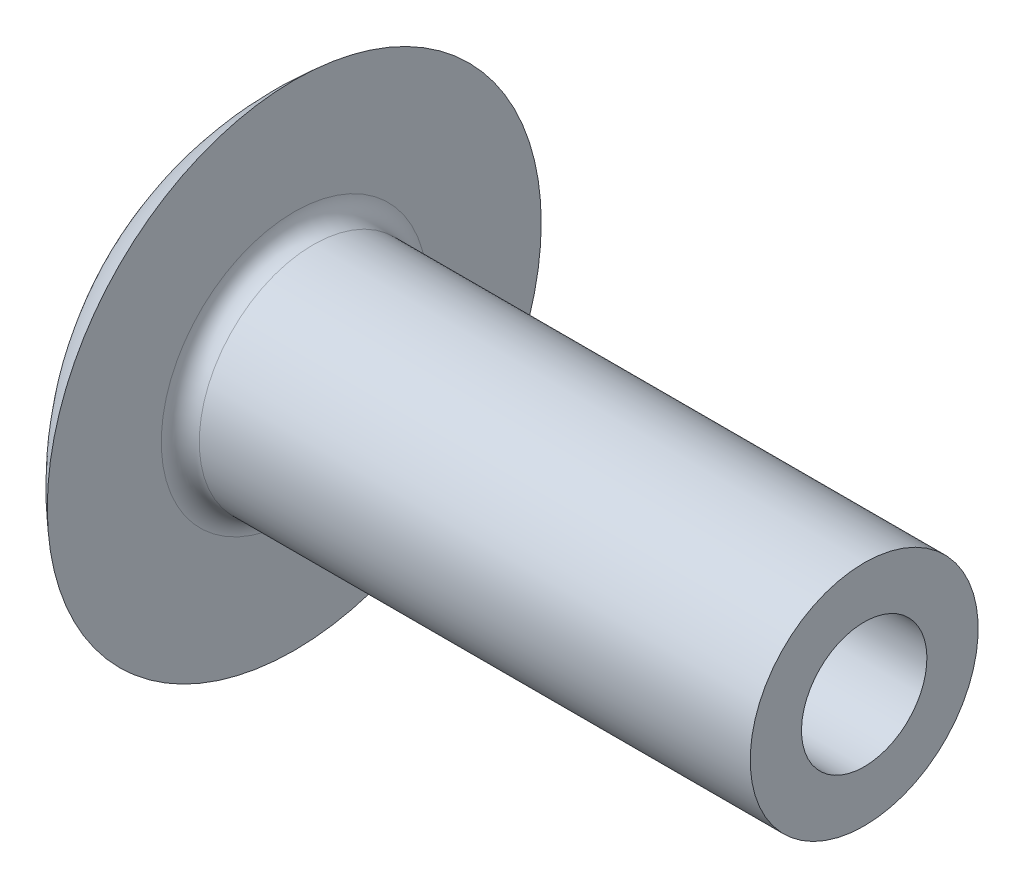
from build123d import *

# Parameters (mm, degrees)
FILLET1_R = 0.1


with BuildPart() as part:
    # Sketch1 → Base-Revolve (revolve)
    with BuildSketch(Plane(origin=(4.242304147, 2.942304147, 0), x_dir=(0, 1, 0), z_dir=(0, 0, 1)), mode=Mode.PRIVATE) as base_revolve_sk:
        with BuildLine():
            Line((-2.612304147, 0.642304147), (-2.342304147, 0.642304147))
            Line((-2.342304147, 0.642304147), (-2.342304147, 3.642304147))
            Line((-2.342304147, 3.642304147), (-1.642304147, 3.642304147))
            ThreePointArc((-1.642304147, 3.642304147), (-2.226413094, 4.085068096), (-2.942304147, 4.242304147))
            Line((-2.942304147, 4.242304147), (-2.942304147, 2.272829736))
            Line((-2.942304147, 2.272829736), (-2.612304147, 2.082304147))
            Line((-2.612304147, 2.082304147), (-2.612304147, 0.642304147))
        make_face()
    revolve(base_revolve_sk.sketch.rotate(Axis((-6.858184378, 0, 0), (1, 0, 0)), 180), axis=Axis((-6.858184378, 0, 0), (1, 0, 0)))

    # Fillet1
    fillet1_edges = [part.edges().sort_by_distance(p)[0] for p in [
        (0.6, 0.6, 0),
    ]]
    fillet(fillet1_edges, radius=FILLET1_R)


solid = part.part
